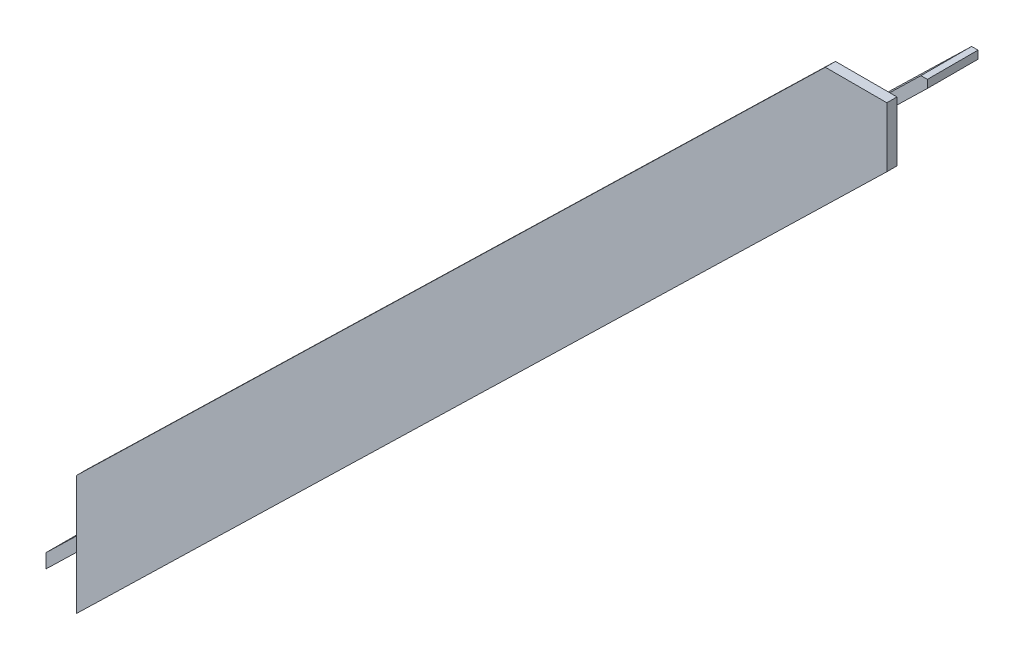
ISO-10303-21;
HEADER;
FILE_DESCRIPTION(('STEP AP214'),'2;1');
FILE_NAME('part.step','',(''),(''),'','','');
FILE_SCHEMA(('AUTOMOTIVE_DESIGN { 1 0 10303 214 1 1 1 1 }'));
ENDSEC;
DATA;
#1=APPLICATION_CONTEXT('core data for automotive mechanical design processes');
#2=APPLICATION_PROTOCOL_DEFINITION('international standard','automotive_design',2000,#1);
#3=PRODUCT_CONTEXT('',#1,'mechanical');
#4=PRODUCT('Part','Part','',(#3));
#5=PRODUCT_RELATED_PRODUCT_CATEGORY('part','',(#4));
#6=PRODUCT_DEFINITION_FORMATION('','',#4);
#7=PRODUCT_DEFINITION_CONTEXT('part definition',#1,'design');
#8=PRODUCT_DEFINITION('design','',#6,#7);
#9=PRODUCT_DEFINITION_SHAPE('','',#8);
#10=(LENGTH_UNIT() NAMED_UNIT(*) SI_UNIT(.MILLI.,.METRE.));
#11=(NAMED_UNIT(*) PLANE_ANGLE_UNIT() SI_UNIT($,.RADIAN.));
#12=(NAMED_UNIT(*) SI_UNIT($,.STERADIAN.) SOLID_ANGLE_UNIT());
#13=UNCERTAINTY_MEASURE_WITH_UNIT(LENGTH_MEASURE(1.E-05),#10,'distance_accuracy_value','');
#14=(GEOMETRIC_REPRESENTATION_CONTEXT(3) GLOBAL_UNCERTAINTY_ASSIGNED_CONTEXT((#13)) GLOBAL_UNIT_ASSIGNED_CONTEXT((#10,
#11,#12)) REPRESENTATION_CONTEXT('',''));
#15=CARTESIAN_POINT('',(0.,0.,0.));
#16=DIRECTION('',(0.,0.,1.));
#17=DIRECTION('',(1.,0.,0.));
#18=AXIS2_PLACEMENT_3D('',#15,#16,#17);
#19=CARTESIAN_POINT('',(0.,0.,870.309999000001));
#20=DIRECTION('',(0.,0.,-1.));
#21=DIRECTION('',(-1.,0.,0.));
#22=AXIS2_PLACEMENT_3D('',#19,#20,#21);
#23=PLANE('',#22);
#24=DIRECTION('',(0.71704537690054,0.697026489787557,0.));
#25=VECTOR('',#24,1.);
#26=CARTESIAN_POINT('',(2142.003059,-859.57998,870.309999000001));
#27=LINE('',#26,#25);
#28=CARTESIAN_POINT('',(2182.003021,-820.696760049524,870.309999));
#29=VERTEX_POINT('',#28);
#30=CARTESIAN_POINT('',(2974.84176731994,-49.992943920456,870.309999));
#31=VERTEX_POINT('',#30);
#32=EDGE_CURVE('E12',#29,#31,#27,.T.);
#33=ORIENTED_EDGE('',*,*,#32,.F.);
#34=DIRECTION('',(0.,1.,0.));
#35=VECTOR('',#34,1.);
#36=CARTESIAN_POINT('',(2182.003021,-886.691988,870.309999));
#37=LINE('',#36,#35);
#38=CARTESIAN_POINT('',(2182.003021,-768.640995,870.309999));
#39=VERTEX_POINT('',#38);
#40=EDGE_CURVE('E189',#29,#39,#37,.T.);
#41=ORIENTED_EDGE('',*,*,#40,.T.);
#42=DIRECTION('',(0.717045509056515,0.697026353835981,0.));
#43=VECTOR('',#42,1.);
#44=CARTESIAN_POINT('',(2182.003021,-768.640995,870.309999));
#45=LINE('',#44,#43);
#46=CARTESIAN_POINT('',(2921.28396,-50.0000010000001,870.309999));
#47=VERTEX_POINT('',#46);
#48=EDGE_CURVE('E184',#39,#47,#45,.T.);
#49=ORIENTED_EDGE('',*,*,#48,.T.);
#50=DIRECTION('',(0.999999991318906,0.000131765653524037,0.));
#51=VECTOR('',#50,1.);
#52=CARTESIAN_POINT('',(2982.012987,-49.991999,870.309999));
#53=LINE('',#52,#51);
#54=EDGE_CURVE('E208',#47,#31,#53,.T.);
#55=ORIENTED_EDGE('',*,*,#54,.T.);
#56=EDGE_LOOP('',(#33,#41,#49,#55));
#57=FACE_BOUND('',#56,.T.);
#58=ADVANCED_FACE('F37',(#57),#23,.T.);
#59=DIRECTION('',(-0.717045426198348,-0.697026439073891,0.));
#60=VECTOR('',#59,1.);
#61=CARTESIAN_POINT('',(3012.003183,-27.814999,870.309999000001));
#62=LINE('',#61,#60);
#63=CARTESIAN_POINT('',(2982.01191624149,-56.968948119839,870.309999));
#64=VERTEX_POINT('',#63);
#65=CARTESIAN_POINT('',(2182.003021,-834.642622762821,870.309999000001));
#66=VERTEX_POINT('',#65);
#67=EDGE_CURVE('E47',#64,#66,#62,.T.);
#68=ORIENTED_EDGE('',*,*,#67,.F.);
#69=DIRECTION('',(-0.000153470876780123,-0.999999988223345,0.));
#70=VECTOR('',#69,1.);
#71=CARTESIAN_POINT('',(2982.003927,-109.026,870.309999));
#72=LINE('',#71,#70);
#73=CARTESIAN_POINT('',(2982.003927,-109.026,870.309999));
#74=VERTEX_POINT('',#73);
#75=EDGE_CURVE('E41',#64,#74,#72,.T.);
#76=ORIENTED_EDGE('',*,*,#75,.T.);
#77=DIRECTION('',(-0.717045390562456,-0.697026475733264,0.));
#78=VECTOR('',#77,1.);
#79=CARTESIAN_POINT('',(2182.003021,-886.691988,870.309999));
#80=LINE('',#79,#78);
#81=CARTESIAN_POINT('',(2182.003021,-886.691988,870.309999));
#82=VERTEX_POINT('',#81);
#83=EDGE_CURVE('E156',#74,#82,#80,.T.);
#84=ORIENTED_EDGE('',*,*,#83,.T.);
#85=EDGE_CURVE('E177',#82,#66,#37,.T.);
#86=ORIENTED_EDGE('',*,*,#85,.T.);
#87=EDGE_LOOP('',(#68,#76,#84,#86));
#88=FACE_BOUND('',#87,.T.);
#89=ADVANCED_FACE('F39',(#88),#23,.T.);
#90=CARTESIAN_POINT('',(0.,0.,880.309999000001));
#91=DIRECTION('',(0.,0.,-1.));
#92=DIRECTION('',(-1.,0.,0.));
#93=AXIS2_PLACEMENT_3D('',#90,#91,#92);
#94=PLANE('',#93);
#95=DIRECTION('',(-0.717045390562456,-0.697026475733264,0.));
#96=VECTOR('',#95,1.);
#97=CARTESIAN_POINT('',(2182.003021,-886.691988,880.309999));
#98=LINE('',#97,#96);
#99=CARTESIAN_POINT('',(2982.003927,-109.026,880.309999));
#100=VERTEX_POINT('',#99);
#101=CARTESIAN_POINT('',(2182.003021,-886.691988,880.309999));
#102=VERTEX_POINT('',#101);
#103=EDGE_CURVE('E167',#100,#102,#98,.T.);
#104=ORIENTED_EDGE('',*,*,#103,.F.);
#105=DIRECTION('',(-0.000153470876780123,-0.999999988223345,0.));
#106=VECTOR('',#105,1.);
#107=CARTESIAN_POINT('',(2982.003927,-109.026,880.309999));
#108=LINE('',#107,#106);
#109=CARTESIAN_POINT('',(2982.012987,-49.991999,880.309999));
#110=VERTEX_POINT('',#109);
#111=EDGE_CURVE('E209',#110,#100,#108,.T.);
#112=ORIENTED_EDGE('',*,*,#111,.F.);
#113=DIRECTION('',(0.999999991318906,0.000131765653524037,0.));
#114=VECTOR('',#113,1.);
#115=CARTESIAN_POINT('',(2982.012987,-49.991999,880.309999));
#116=LINE('',#115,#114);
#117=CARTESIAN_POINT('',(2921.28396,-50.0000010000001,880.309999));
#118=VERTEX_POINT('',#117);
#119=EDGE_CURVE('E274',#118,#110,#116,.T.);
#120=ORIENTED_EDGE('',*,*,#119,.F.);
#121=DIRECTION('',(0.717045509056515,0.697026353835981,0.));
#122=VECTOR('',#121,1.);
#123=CARTESIAN_POINT('',(2182.003021,-768.640995,880.309999));
#124=LINE('',#123,#122);
#125=CARTESIAN_POINT('',(2182.003021,-768.640995,880.309999));
#126=VERTEX_POINT('',#125);
#127=EDGE_CURVE('E183',#126,#118,#124,.T.);
#128=ORIENTED_EDGE('',*,*,#127,.F.);
#129=DIRECTION('',(0.,1.,0.));
#130=VECTOR('',#129,1.);
#131=CARTESIAN_POINT('',(2182.003021,-886.691988,880.309999));
#132=LINE('',#131,#130);
#133=EDGE_CURVE('E174',#102,#126,#132,.T.);
#134=ORIENTED_EDGE('',*,*,#133,.F.);
#135=EDGE_LOOP('',(#104,#112,#120,#128,#134));
#136=FACE_BOUND('',#135,.T.);
#137=ADVANCED_FACE('F308',(#136),#94,.F.);
#138=CARTESIAN_POINT('',(2182.003021,-886.691988,880.309999));
#139=DIRECTION('',(0.697026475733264,-0.717045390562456,0.));
#140=DIRECTION('',(0.717045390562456,0.697026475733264,0.));
#141=AXIS2_PLACEMENT_3D('',#138,#139,#140);
#142=PLANE('',#141);
#143=ORIENTED_EDGE('',*,*,#83,.F.);
#144=DIRECTION('',(0.,0.,-1.));
#145=VECTOR('',#144,1.);
#146=CARTESIAN_POINT('',(2982.003927,-109.026,880.309999));
#147=LINE('',#146,#145);
#148=EDGE_CURVE('E158',#100,#74,#147,.T.);
#149=ORIENTED_EDGE('',*,*,#148,.F.);
#150=ORIENTED_EDGE('',*,*,#103,.T.);
#151=DIRECTION('',(0.,0.,-1.));
#152=VECTOR('',#151,1.);
#153=CARTESIAN_POINT('',(2182.003021,-886.691988,880.309999));
#154=LINE('',#153,#152);
#155=EDGE_CURVE('E164',#102,#82,#154,.T.);
#156=ORIENTED_EDGE('',*,*,#155,.T.);
#157=EDGE_LOOP('',(#143,#149,#150,#156));
#158=FACE_BOUND('',#157,.T.);
#159=ADVANCED_FACE('F235',(#158),#142,.T.);
#160=CARTESIAN_POINT('',(2982.003927,-109.026,880.309999));
#161=DIRECTION('',(0.999999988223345,-0.000153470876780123,0.));
#162=DIRECTION('',(0.000153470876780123,0.999999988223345,0.));
#163=AXIS2_PLACEMENT_3D('',#160,#161,#162);
#164=PLANE('',#163);
#165=CARTESIAN_POINT('',(2982.012987,-49.991999,870.309999));
#166=VERTEX_POINT('',#165);
#167=EDGE_CURVE('E217',#166,#64,#72,.T.);
#168=ORIENTED_EDGE('',*,*,#167,.F.);
#169=DIRECTION('',(0.,0.,-1.));
#170=VECTOR('',#169,1.);
#171=CARTESIAN_POINT('',(2982.012987,-49.991999,880.309999));
#172=LINE('',#171,#170);
#173=EDGE_CURVE('E214',#110,#166,#172,.T.);
#174=ORIENTED_EDGE('',*,*,#173,.F.);
#175=ORIENTED_EDGE('',*,*,#111,.T.);
#176=ORIENTED_EDGE('',*,*,#148,.T.);
#177=ORIENTED_EDGE('',*,*,#75,.F.);
#178=EDGE_LOOP('',(#168,#174,#175,#176,#177));
#179=FACE_BOUND('',#178,.T.);
#180=ADVANCED_FACE('F232',(#179),#164,.T.);
#181=CARTESIAN_POINT('',(2982.012987,-49.991999,880.309999));
#182=DIRECTION('',(-0.000131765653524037,0.999999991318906,0.));
#183=DIRECTION('',(-0.999999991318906,-0.000131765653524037,0.));
#184=AXIS2_PLACEMENT_3D('',#181,#182,#183);
#185=PLANE('',#184);
#186=ORIENTED_EDGE('',*,*,#54,.F.);
#187=DIRECTION('',(0.,0.,-1.));
#188=VECTOR('',#187,1.);
#189=CARTESIAN_POINT('',(2921.28396,-50.000001,880.309999));
#190=LINE('',#189,#188);
#191=EDGE_CURVE('E277',#118,#47,#190,.T.);
#192=ORIENTED_EDGE('',*,*,#191,.F.);
#193=ORIENTED_EDGE('',*,*,#119,.T.);
#194=ORIENTED_EDGE('',*,*,#173,.T.);
#195=EDGE_CURVE('E64',#31,#166,#53,.T.);
#196=ORIENTED_EDGE('',*,*,#195,.F.);
#197=EDGE_LOOP('',(#186,#192,#193,#194,#196));
#198=FACE_BOUND('',#197,.T.);
#199=ADVANCED_FACE('F275',(#198),#185,.T.);
#200=CARTESIAN_POINT('',(2182.003021,-768.640995,880.309999));
#201=DIRECTION('',(-0.697026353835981,0.717045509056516,0.));
#202=DIRECTION('',(-0.717045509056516,-0.697026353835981,0.));
#203=AXIS2_PLACEMENT_3D('',#200,#201,#202);
#204=PLANE('',#203);
#205=ORIENTED_EDGE('',*,*,#48,.F.);
#206=DIRECTION('',(0.,0.,-1.));
#207=VECTOR('',#206,1.);
#208=CARTESIAN_POINT('',(2182.003021,-768.640995,880.309999));
#209=LINE('',#208,#207);
#210=EDGE_CURVE('E180',#126,#39,#209,.T.);
#211=ORIENTED_EDGE('',*,*,#210,.F.);
#212=ORIENTED_EDGE('',*,*,#127,.T.);
#213=ORIENTED_EDGE('',*,*,#191,.T.);
#214=EDGE_LOOP('',(#205,#211,#212,#213));
#215=FACE_BOUND('',#214,.T.);
#216=ADVANCED_FACE('F310',(#215),#204,.T.);
#217=CARTESIAN_POINT('',(2182.003021,-886.691988,880.309999));
#218=DIRECTION('',(-1.,0.,0.));
#219=DIRECTION('',(0.,0.,1.));
#220=AXIS2_PLACEMENT_3D('',#217,#218,#219);
#221=PLANE('',#220);
#222=ORIENTED_EDGE('',*,*,#85,.F.);
#223=ORIENTED_EDGE('',*,*,#155,.F.);
#224=ORIENTED_EDGE('',*,*,#133,.T.);
#225=ORIENTED_EDGE('',*,*,#210,.T.);
#226=ORIENTED_EDGE('',*,*,#40,.F.);
#227=EDGE_CURVE('E195',#66,#29,#37,.T.);
#228=ORIENTED_EDGE('',*,*,#227,.F.);
#229=EDGE_LOOP('',(#222,#223,#224,#225,#226,#228));
#230=FACE_BOUND('',#229,.T.);
#231=ADVANCED_FACE('F242',(#230),#221,.T.);
#232=CARTESIAN_POINT('',(0.,0.,870.309999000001));
#233=DIRECTION('',(0.,0.,-1.));
#234=DIRECTION('',(-1.,0.,0.));
#235=AXIS2_PLACEMENT_3D('',#232,#233,#234);
#236=PLANE('',#235);
#237=CARTESIAN_POINT('',(2142.00806599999,-873.520970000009,870.309999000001));
#238=VERTEX_POINT('',#237);
#239=EDGE_CURVE('E246',#66,#238,#62,.T.);
#240=ORIENTED_EDGE('',*,*,#239,.F.);
#241=ORIENTED_EDGE('',*,*,#227,.T.);
#242=CARTESIAN_POINT('',(2142.003059,-859.57998,870.309999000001));
#243=VERTEX_POINT('',#242);
#244=EDGE_CURVE('E49',#243,#29,#27,.T.);
#245=ORIENTED_EDGE('',*,*,#244,.F.);
#246=DIRECTION('',(-0.000359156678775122,0.999999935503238,0.));
#247=VECTOR('',#246,1.);
#248=CARTESIAN_POINT('',(2142.00806599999,-873.520970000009,870.309999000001));
#249=LINE('',#248,#247);
#250=EDGE_CURVE('E150',#238,#243,#249,.T.);
#251=ORIENTED_EDGE('',*,*,#250,.F.);
#252=EDGE_LOOP('',(#240,#241,#245,#251));
#253=FACE_BOUND('',#252,.T.);
#254=ADVANCED_FACE('F247',(#253),#236,.F.);
#255=CARTESIAN_POINT('',(3005.692005,-20.004001,870.309999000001));
#256=VERTEX_POINT('',#255);
#257=EDGE_CURVE('E50',#31,#256,#27,.T.);
#258=ORIENTED_EDGE('',*,*,#257,.F.);
#259=ORIENTED_EDGE('',*,*,#195,.T.);
#260=ORIENTED_EDGE('',*,*,#167,.T.);
#261=CARTESIAN_POINT('',(3012.003183,-27.814999,870.309999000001));
#262=VERTEX_POINT('',#261);
#263=EDGE_CURVE('E251',#262,#64,#62,.T.);
#264=ORIENTED_EDGE('',*,*,#263,.F.);
#265=DIRECTION('',(0.00039679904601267,-0.999999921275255,0.));
#266=VECTOR('',#265,1.);
#267=CARTESIAN_POINT('',(3012.000084,-20.005001,870.309999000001));
#268=LINE('',#267,#266);
#269=CARTESIAN_POINT('',(3012.000084,-20.005001,870.309999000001));
#270=VERTEX_POINT('',#269);
#271=EDGE_CURVE('E252',#270,#262,#268,.T.);
#272=ORIENTED_EDGE('',*,*,#271,.F.);
#273=DIRECTION('',(0.999999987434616,-0.000158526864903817,0.));
#274=VECTOR('',#273,1.);
#275=CARTESIAN_POINT('',(3005.692005,-20.004001,870.309999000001));
#276=LINE('',#275,#274);
#277=EDGE_CURVE('E288',#256,#270,#276,.T.);
#278=ORIENTED_EDGE('',*,*,#277,.F.);
#279=EDGE_LOOP('',(#258,#259,#260,#264,#272,#278));
#280=FACE_BOUND('',#279,.T.);
#281=ADVANCED_FACE('F271',(#280),#236,.F.);
#282=CARTESIAN_POINT('',(2142.003059,-859.57998,820.309999));
#283=DIRECTION('',(0.697026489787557,-0.71704537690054,0.));
#284=DIRECTION('',(0.71704537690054,0.697026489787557,0.));
#285=AXIS2_PLACEMENT_3D('',#282,#283,#284);
#286=PLANE('',#285);
#287=ORIENTED_EDGE('',*,*,#244,.T.);
#288=ORIENTED_EDGE('',*,*,#32,.T.);
#289=ORIENTED_EDGE('',*,*,#257,.T.);
#290=DIRECTION('',(0.,0.,1.));
#291=VECTOR('',#290,1.);
#292=CARTESIAN_POINT('',(3005.692005,-20.004001,820.309999));
#293=LINE('',#292,#291);
#294=CARTESIAN_POINT('',(3005.692005,-20.004001,820.309999));
#295=VERTEX_POINT('',#294);
#296=EDGE_CURVE('E135',#295,#256,#293,.T.);
#297=ORIENTED_EDGE('',*,*,#296,.F.);
#298=DIRECTION('',(0.71704537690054,0.697026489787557,0.));
#299=VECTOR('',#298,1.);
#300=CARTESIAN_POINT('',(2142.003059,-859.57998,820.309999));
#301=LINE('',#300,#299);
#302=CARTESIAN_POINT('',(2142.003059,-859.57998,820.309999));
#303=VERTEX_POINT('',#302);
#304=EDGE_CURVE('E141',#303,#295,#301,.T.);
#305=ORIENTED_EDGE('',*,*,#304,.F.);
#306=DIRECTION('',(0.,0.,1.));
#307=VECTOR('',#306,1.);
#308=CARTESIAN_POINT('',(2142.003059,-859.57998,820.309999));
#309=LINE('',#308,#307);
#310=EDGE_CURVE('E262',#303,#243,#309,.T.);
#311=ORIENTED_EDGE('',*,*,#310,.T.);
#312=EDGE_LOOP('',(#287,#288,#289,#297,#305,#311));
#313=FACE_BOUND('',#312,.T.);
#314=ADVANCED_FACE('F153',(#313),#286,.F.);
#315=CARTESIAN_POINT('',(3005.692005,-20.004001,820.309999));
#316=DIRECTION('',(-0.000158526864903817,-0.999999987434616,0.));
#317=DIRECTION('',(0.999999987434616,-0.000158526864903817,0.));
#318=AXIS2_PLACEMENT_3D('',#315,#316,#317);
#319=PLANE('',#318);
#320=ORIENTED_EDGE('',*,*,#277,.T.);
#321=DIRECTION('',(0.,0.,1.));
#322=VECTOR('',#321,1.);
#323=CARTESIAN_POINT('',(3012.000084,-20.005001,820.309999));
#324=LINE('',#323,#322);
#325=CARTESIAN_POINT('',(3012.000084,-20.005001,820.309999));
#326=VERTEX_POINT('',#325);
#327=EDGE_CURVE('E137',#326,#270,#324,.T.);
#328=ORIENTED_EDGE('',*,*,#327,.F.);
#329=DIRECTION('',(0.999999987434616,-0.000158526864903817,0.));
#330=VECTOR('',#329,1.);
#331=CARTESIAN_POINT('',(3005.692005,-20.004001,820.309999));
#332=LINE('',#331,#330);
#333=EDGE_CURVE('E131',#295,#326,#332,.T.);
#334=ORIENTED_EDGE('',*,*,#333,.F.);
#335=ORIENTED_EDGE('',*,*,#296,.T.);
#336=EDGE_LOOP('',(#320,#328,#334,#335));
#337=FACE_BOUND('',#336,.T.);
#338=ADVANCED_FACE('F133',(#337),#319,.F.);
#339=CARTESIAN_POINT('',(3012.000084,-20.005001,820.309999));
#340=DIRECTION('',(-0.999999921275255,-0.00039679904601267,0.));
#341=DIRECTION('',(0.00039679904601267,-0.999999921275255,0.));
#342=AXIS2_PLACEMENT_3D('',#339,#340,#341);
#343=PLANE('',#342);
#344=ORIENTED_EDGE('',*,*,#271,.T.);
#345=DIRECTION('',(0.,0.,1.));
#346=VECTOR('',#345,1.);
#347=CARTESIAN_POINT('',(3012.003183,-27.814999,820.309999));
#348=LINE('',#347,#346);
#349=CARTESIAN_POINT('',(3012.003183,-27.814999,820.309999));
#350=VERTEX_POINT('',#349);
#351=EDGE_CURVE('E160',#350,#262,#348,.T.);
#352=ORIENTED_EDGE('',*,*,#351,.F.);
#353=DIRECTION('',(0.00039679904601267,-0.999999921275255,0.));
#354=VECTOR('',#353,1.);
#355=CARTESIAN_POINT('',(3012.000084,-20.005001,820.309999));
#356=LINE('',#355,#354);
#357=EDGE_CURVE('E140',#326,#350,#356,.T.);
#358=ORIENTED_EDGE('',*,*,#357,.F.);
#359=ORIENTED_EDGE('',*,*,#327,.T.);
#360=EDGE_LOOP('',(#344,#352,#358,#359));
#361=FACE_BOUND('',#360,.T.);
#362=ADVANCED_FACE('F292',(#361),#343,.F.);
#363=CARTESIAN_POINT('',(3012.003183,-27.814999,820.309999));
#364=DIRECTION('',(-0.697026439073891,0.717045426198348,0.));
#365=DIRECTION('',(-0.717045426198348,-0.697026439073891,0.));
#366=AXIS2_PLACEMENT_3D('',#363,#364,#365);
#367=PLANE('',#366);
#368=ORIENTED_EDGE('',*,*,#263,.T.);
#369=ORIENTED_EDGE('',*,*,#67,.T.);
#370=ORIENTED_EDGE('',*,*,#239,.T.);
#371=DIRECTION('',(0.,0.,1.));
#372=VECTOR('',#371,1.);
#373=CARTESIAN_POINT('',(2142.00806599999,-873.520970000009,820.309999));
#374=LINE('',#373,#372);
#375=CARTESIAN_POINT('',(2142.00806599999,-873.520970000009,820.309999));
#376=VERTEX_POINT('',#375);
#377=EDGE_CURVE('E264',#376,#238,#374,.T.);
#378=ORIENTED_EDGE('',*,*,#377,.F.);
#379=DIRECTION('',(-0.717045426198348,-0.697026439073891,0.));
#380=VECTOR('',#379,1.);
#381=CARTESIAN_POINT('',(3012.003183,-27.814999,820.309999));
#382=LINE('',#381,#380);
#383=EDGE_CURVE('E267',#350,#376,#382,.T.);
#384=ORIENTED_EDGE('',*,*,#383,.F.);
#385=ORIENTED_EDGE('',*,*,#351,.T.);
#386=EDGE_LOOP('',(#368,#369,#370,#378,#384,#385));
#387=FACE_BOUND('',#386,.T.);
#388=ADVANCED_FACE('F255',(#387),#367,.F.);
#389=CARTESIAN_POINT('',(2142.00806599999,-873.520970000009,820.309999));
#390=DIRECTION('',(0.999999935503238,0.000359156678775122,0.));
#391=DIRECTION('',(-0.000359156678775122,0.999999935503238,0.));
#392=AXIS2_PLACEMENT_3D('',#389,#390,#391);
#393=PLANE('',#392);
#394=ORIENTED_EDGE('',*,*,#250,.T.);
#395=ORIENTED_EDGE('',*,*,#310,.F.);
#396=DIRECTION('',(-0.000359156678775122,0.999999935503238,0.));
#397=VECTOR('',#396,1.);
#398=CARTESIAN_POINT('',(2142.00806599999,-873.520970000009,820.309999));
#399=LINE('',#398,#397);
#400=EDGE_CURVE('E146',#376,#303,#399,.T.);
#401=ORIENTED_EDGE('',*,*,#400,.F.);
#402=ORIENTED_EDGE('',*,*,#377,.T.);
#403=EDGE_LOOP('',(#394,#395,#401,#402));
#404=FACE_BOUND('',#403,.T.);
#405=ADVANCED_FACE('F294',(#404),#393,.F.);
#406=CARTESIAN_POINT('',(0.,0.,820.309999));
#407=DIRECTION('',(0.,0.,-1.));
#408=DIRECTION('',(-1.,0.,0.));
#409=AXIS2_PLACEMENT_3D('',#406,#407,#408);
#410=PLANE('',#409);
#411=ORIENTED_EDGE('',*,*,#304,.T.);
#412=ORIENTED_EDGE('',*,*,#333,.T.);
#413=ORIENTED_EDGE('',*,*,#357,.T.);
#414=ORIENTED_EDGE('',*,*,#383,.T.);
#415=ORIENTED_EDGE('',*,*,#400,.T.);
#416=EDGE_LOOP('',(#411,#412,#413,#414,#415));
#417=FACE_BOUND('',#416,.T.);
#418=ADVANCED_FACE('F144',(#417),#410,.T.);
#419=CLOSED_SHELL('',(#58,#89,#137,#159,#180,#199,#216,#231,#254,#281,#314,#338,#362,#388,#405,#418));
#420=MANIFOLD_SOLID_BREP('B2',#419);
#421=ADVANCED_BREP_SHAPE_REPRESENTATION('',(#18,#420),#14);
#422=SHAPE_DEFINITION_REPRESENTATION(#9,#421);
ENDSEC;
END-ISO-10303-21;
